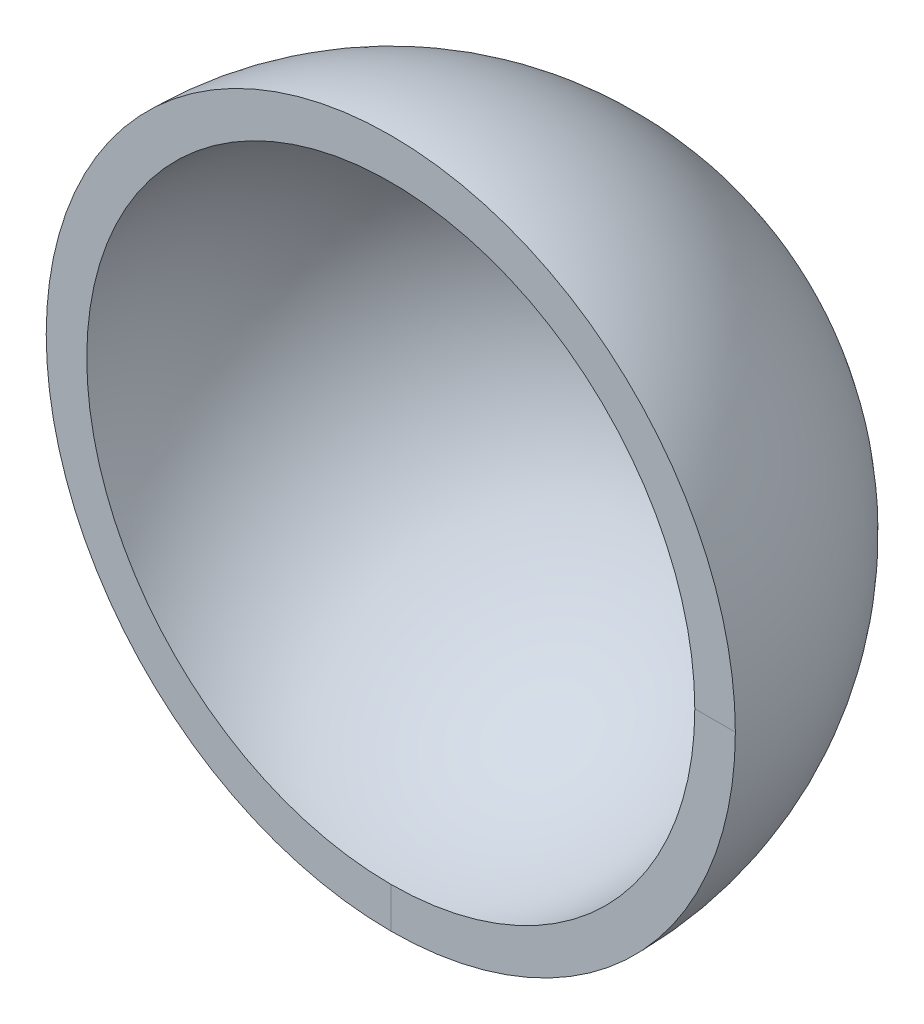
from build123d import *

# Parameters (mm, degrees)
REVOLVE1_ANGLE = 180


with BuildPart() as part:
    # Sketch1 → Revolve1 (revolve)
    with BuildSketch(Plane.XY):
        with BuildLine():
            Line((0, 43.18), (0, 40.64))
            ThreePointArc((0, 40.64), (19.05, 21.59), (0, 2.54))
            Line((0, 2.54), (0, 0))
            ThreePointArc((0, 0), (21.59, 21.59), (0, 43.18))
        make_face()
    revolve(axis=Axis((0, 0, 0), (0, 1, 0)), revolution_arc=REVOLVE1_ANGLE)


solid = part.part
